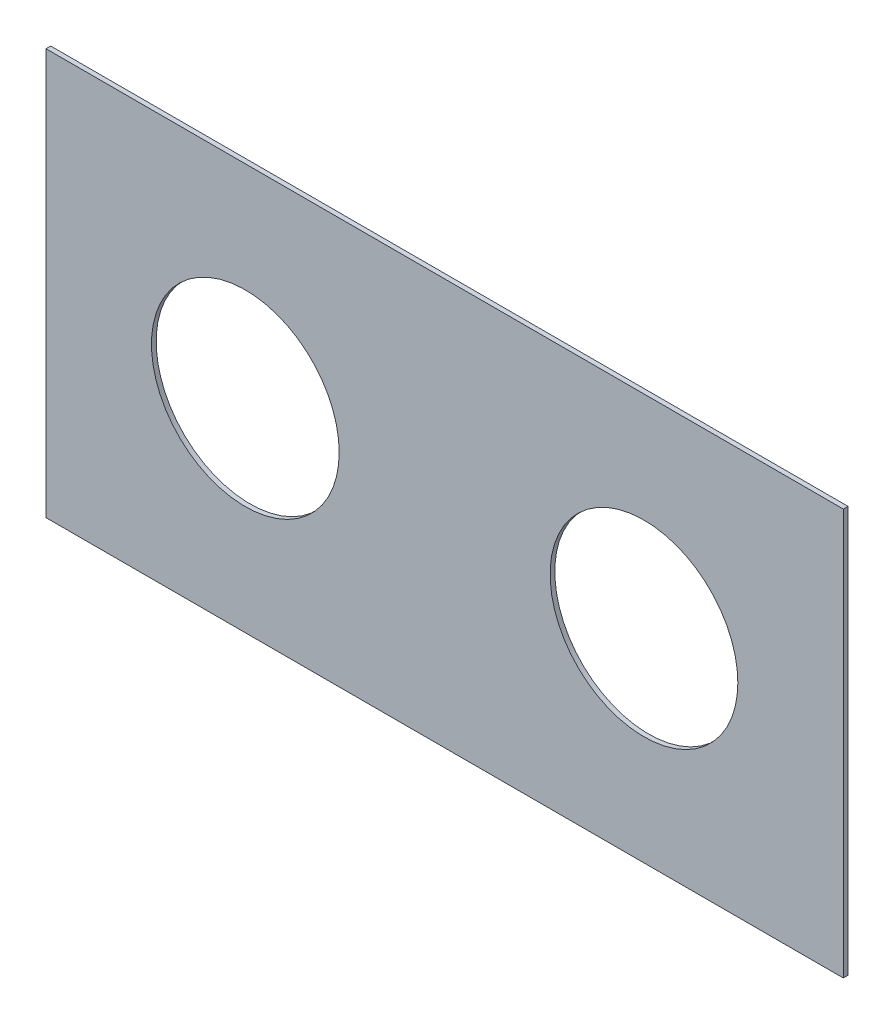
from build123d import *

# Parameters (mm, degrees)
ESQUISSE1_W        = 509.6
ESQUISSE1_H        = 259.6
ESQUISSE1_R        = 60
BOSS_EXTRU_1_DEPTH = 3


with BuildPart() as part:
    # Esquisse1 → Boss.-Extru.1 (new body)
    with BuildSketch(Plane.XY):
        Rectangle(ESQUISSE1_W, ESQUISSE1_H)
        with Locations((-127.4, 0)):
            Circle(ESQUISSE1_R, mode=Mode.SUBTRACT)
        with Locations((127.4, 0)):
            Circle(ESQUISSE1_R, mode=Mode.SUBTRACT)
    extrude(amount=BOSS_EXTRU_1_DEPTH)


solid = part.part
